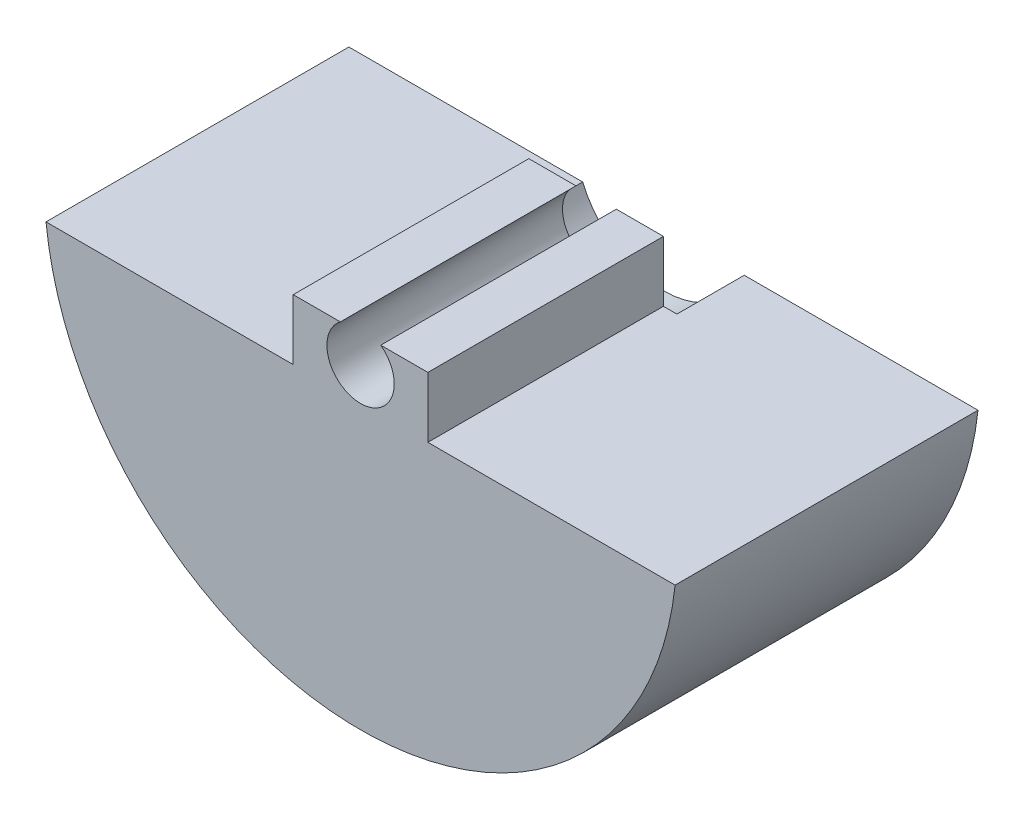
from build123d import *

# Parameters (mm, degrees)
EXTRUSION1_DEPTH        = 4.5
ESQUISSE2_R             = 1.3
ENL_V_MAT_EXTRU_1_DEPTH = 1


with BuildPart() as part:
    # Esquisse1 → Extrusion1 (new body)
    with BuildSketch(Plane.XY):
        with BuildLine():
            Line((0.3, 0.4), (1, 0.4))
            Line((1, 0.4), (1, -0.5))
            Line((1, -0.5), (4.673328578, -0.5))
            ThreePointArc((4.673328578, -0.5), (0, -4.7), (-4.673328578, -0.5))
            Line((-4.673328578, -0.5), (-1, -0.5))
            Line((-1, -0.5), (-1, 0.4))
            Line((-1, 0.4), (-0.3, 0.4))
            ThreePointArc((-0.3, 0.4), (0, -0.5), (0.3, 0.4))
        make_face()
    extrude(amount=-EXTRUSION1_DEPTH)

    # Esquisse2 → Enl_v. mat.-Extru.1 (cut)
    with BuildSketch(Plane(origin=(0, 0, -4.5), x_dir=(-1, 0, 0), z_dir=(0, 0, -1))):
        Circle(ESQUISSE2_R)
    extrude(amount=-ENL_V_MAT_EXTRU_1_DEPTH, mode=Mode.SUBTRACT)


solid = part.part
